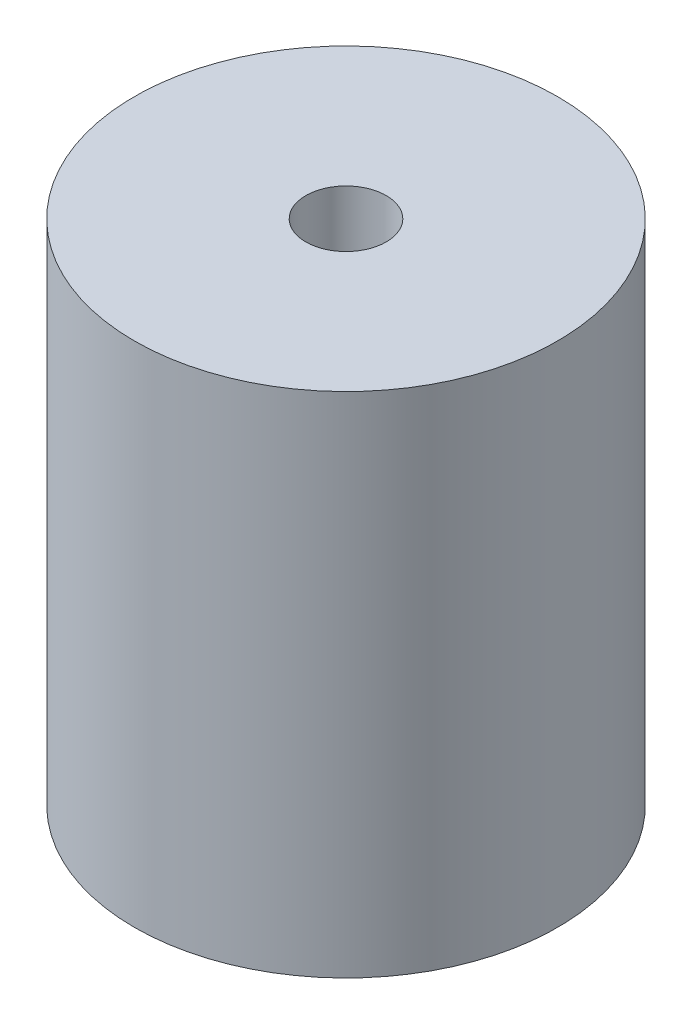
ISO-10303-21;
HEADER;
FILE_DESCRIPTION(('STEP AP214'),'2;1');
FILE_NAME('part.step','',(''),(''),'','','');
FILE_SCHEMA(('AUTOMOTIVE_DESIGN { 1 0 10303 214 1 1 1 1 }'));
ENDSEC;
DATA;
#1=APPLICATION_CONTEXT('core data for automotive mechanical design processes');
#2=APPLICATION_PROTOCOL_DEFINITION('international standard','automotive_design',2000,#1);
#3=PRODUCT_CONTEXT('',#1,'mechanical');
#4=PRODUCT('Part','Part','',(#3));
#5=PRODUCT_RELATED_PRODUCT_CATEGORY('part','',(#4));
#6=PRODUCT_DEFINITION_FORMATION('','',#4);
#7=PRODUCT_DEFINITION_CONTEXT('part definition',#1,'design');
#8=PRODUCT_DEFINITION('design','',#6,#7);
#9=PRODUCT_DEFINITION_SHAPE('','',#8);
#10=(LENGTH_UNIT() NAMED_UNIT(*) SI_UNIT(.MILLI.,.METRE.));
#11=(NAMED_UNIT(*) PLANE_ANGLE_UNIT() SI_UNIT($,.RADIAN.));
#12=(NAMED_UNIT(*) SI_UNIT($,.STERADIAN.) SOLID_ANGLE_UNIT());
#13=UNCERTAINTY_MEASURE_WITH_UNIT(LENGTH_MEASURE(1.E-05),#10,'distance_accuracy_value','');
#14=(GEOMETRIC_REPRESENTATION_CONTEXT(3) GLOBAL_UNCERTAINTY_ASSIGNED_CONTEXT((#13)) GLOBAL_UNIT_ASSIGNED_CONTEXT((#10,
#11,#12)) REPRESENTATION_CONTEXT('',''));
#15=CARTESIAN_POINT('',(0.,0.,0.));
#16=DIRECTION('',(0.,0.,1.));
#17=DIRECTION('',(1.,0.,0.));
#18=AXIS2_PLACEMENT_3D('',#15,#16,#17);
#19=CARTESIAN_POINT('',(0.,12.,0.));
#20=DIRECTION('',(0.,1.,0.));
#21=DIRECTION('',(0.,0.,1.));
#22=AXIS2_PLACEMENT_3D('',#19,#20,#21);
#23=PLANE('',#22);
#24=CARTESIAN_POINT('',(0.,12.,0.));
#25=DIRECTION('',(0.,1.,0.));
#26=DIRECTION('',(0.,0.,1.));
#27=AXIS2_PLACEMENT_3D('',#24,#25,#26);
#28=CIRCLE('',#27,5.);
#29=CARTESIAN_POINT('',(0.,12.,5.));
#30=VERTEX_POINT('',#29);
#31=EDGE_CURVE('E10',#30,#30,#28,.T.);
#32=ORIENTED_EDGE('',*,*,#31,.T.);
#33=EDGE_LOOP('',(#32));
#34=FACE_BOUND('',#33,.T.);
#35=CARTESIAN_POINT('',(0.,12.,0.));
#36=DIRECTION('',(0.,1.,0.));
#37=DIRECTION('',(0.,0.,1.));
#38=AXIS2_PLACEMENT_3D('',#35,#36,#37);
#39=CIRCLE('',#38,0.95);
#40=CARTESIAN_POINT('',(0.,12.,0.95));
#41=VERTEX_POINT('',#40);
#42=EDGE_CURVE('E40',#41,#41,#39,.T.);
#43=ORIENTED_EDGE('',*,*,#42,.F.);
#44=EDGE_LOOP('',(#43));
#45=FACE_BOUND('',#44,.T.);
#46=ADVANCED_FACE('F29',(#34,#45),#23,.T.);
#47=CARTESIAN_POINT('',(0.,0.,0.));
#48=DIRECTION('',(0.,1.,0.));
#49=DIRECTION('',(0.,0.,1.));
#50=AXIS2_PLACEMENT_3D('',#47,#48,#49);
#51=PLANE('',#50);
#52=CARTESIAN_POINT('',(0.,0.,0.));
#53=DIRECTION('',(0.,1.,0.));
#54=DIRECTION('',(0.,0.,1.));
#55=AXIS2_PLACEMENT_3D('',#52,#53,#54);
#56=CIRCLE('',#55,5.);
#57=CARTESIAN_POINT('',(0.,0.,5.));
#58=VERTEX_POINT('',#57);
#59=EDGE_CURVE('E33',#58,#58,#56,.T.);
#60=ORIENTED_EDGE('',*,*,#59,.F.);
#61=EDGE_LOOP('',(#60));
#62=FACE_BOUND('',#61,.T.);
#63=CARTESIAN_POINT('',(0.,0.,0.));
#64=DIRECTION('',(0.,1.,0.));
#65=DIRECTION('',(0.,0.,1.));
#66=AXIS2_PLACEMENT_3D('',#63,#64,#65);
#67=CIRCLE('',#66,0.95);
#68=CARTESIAN_POINT('',(0.,0.,0.95));
#69=VERTEX_POINT('',#68);
#70=EDGE_CURVE('E42',#69,#69,#67,.T.);
#71=ORIENTED_EDGE('',*,*,#70,.T.);
#72=EDGE_LOOP('',(#71));
#73=FACE_BOUND('',#72,.T.);
#74=ADVANCED_FACE('F52',(#62,#73),#51,.F.);
#75=CARTESIAN_POINT('',(0.,12.,0.));
#76=DIRECTION('',(0.,-1.,0.));
#77=DIRECTION('',(0.,0.,-1.));
#78=AXIS2_PLACEMENT_3D('',#75,#76,#77);
#79=CYLINDRICAL_SURFACE('',#78,5.);
#80=ORIENTED_EDGE('',*,*,#31,.F.);
#81=EDGE_LOOP('',(#80));
#82=FACE_BOUND('',#81,.T.);
#83=ORIENTED_EDGE('',*,*,#59,.T.);
#84=EDGE_LOOP('',(#83));
#85=FACE_BOUND('',#84,.T.);
#86=ADVANCED_FACE('F31',(#82,#85),#79,.T.);
#87=CARTESIAN_POINT('',(0.,12.,0.));
#88=DIRECTION('',(0.,-1.,0.));
#89=DIRECTION('',(0.,0.,-1.));
#90=AXIS2_PLACEMENT_3D('',#87,#88,#89);
#91=CYLINDRICAL_SURFACE('',#90,0.95);
#92=ORIENTED_EDGE('',*,*,#42,.T.);
#93=EDGE_LOOP('',(#92));
#94=FACE_BOUND('',#93,.T.);
#95=ORIENTED_EDGE('',*,*,#70,.F.);
#96=EDGE_LOOP('',(#95));
#97=FACE_BOUND('',#96,.T.);
#98=ADVANCED_FACE('F48',(#94,#97),#91,.F.);
#99=CLOSED_SHELL('',(#46,#74,#86,#98));
#100=MANIFOLD_SOLID_BREP('B2',#99);
#101=ADVANCED_BREP_SHAPE_REPRESENTATION('',(#18,#100),#14);
#102=SHAPE_DEFINITION_REPRESENTATION(#9,#101);
ENDSEC;
END-ISO-10303-21;
